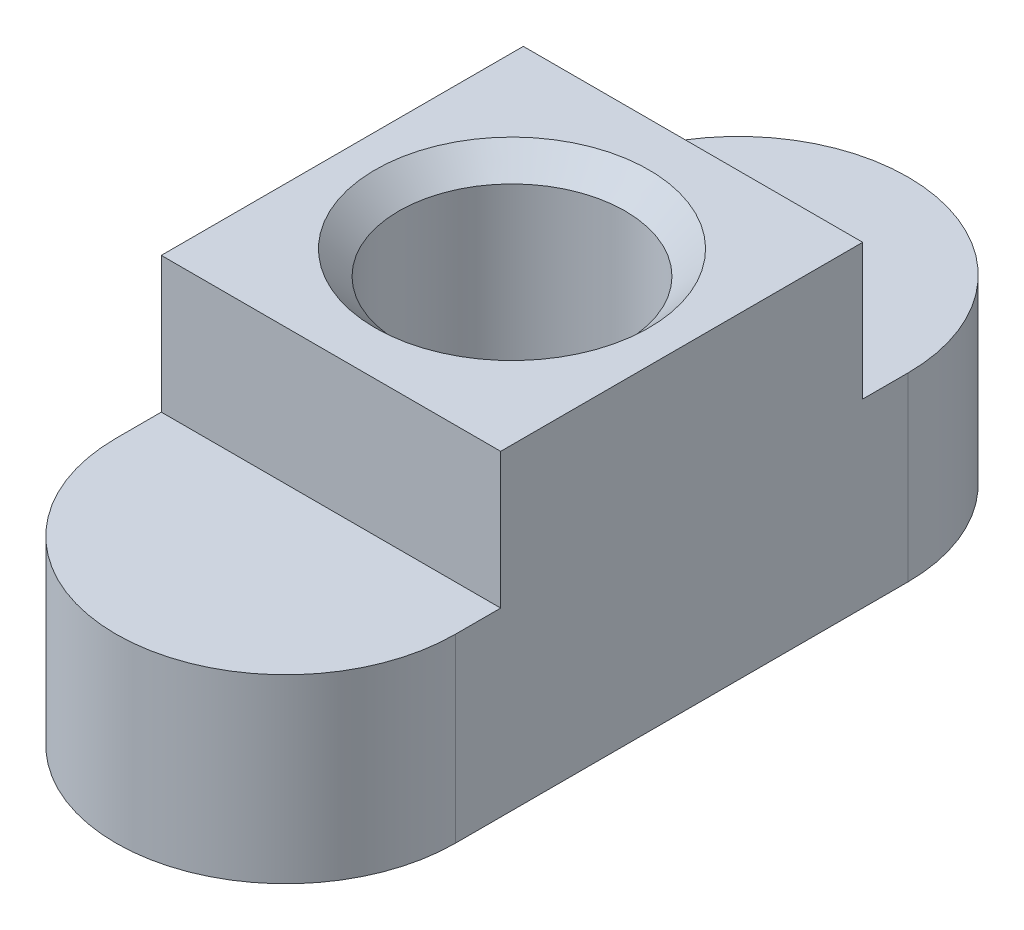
ISO-10303-21;
HEADER;
FILE_DESCRIPTION(('STEP AP214'),'2;1');
FILE_NAME('part.step','',(''),(''),'','','');
FILE_SCHEMA(('AUTOMOTIVE_DESIGN { 1 0 10303 214 1 1 1 1 }'));
ENDSEC;
DATA;
#1=APPLICATION_CONTEXT('core data for automotive mechanical design processes');
#2=APPLICATION_PROTOCOL_DEFINITION('international standard','automotive_design',2000,#1);
#3=PRODUCT_CONTEXT('',#1,'mechanical');
#4=PRODUCT('Part','Part','',(#3));
#5=PRODUCT_RELATED_PRODUCT_CATEGORY('part','',(#4));
#6=PRODUCT_DEFINITION_FORMATION('','',#4);
#7=PRODUCT_DEFINITION_CONTEXT('part definition',#1,'design');
#8=PRODUCT_DEFINITION('design','',#6,#7);
#9=PRODUCT_DEFINITION_SHAPE('','',#8);
#10=(LENGTH_UNIT() NAMED_UNIT(*) SI_UNIT(.MILLI.,.METRE.));
#11=(NAMED_UNIT(*) PLANE_ANGLE_UNIT() SI_UNIT($,.RADIAN.));
#12=(NAMED_UNIT(*) SI_UNIT($,.STERADIAN.) SOLID_ANGLE_UNIT());
#13=UNCERTAINTY_MEASURE_WITH_UNIT(LENGTH_MEASURE(1.E-05),#10,'distance_accuracy_value','');
#14=(GEOMETRIC_REPRESENTATION_CONTEXT(3) GLOBAL_UNCERTAINTY_ASSIGNED_CONTEXT((#13)) GLOBAL_UNIT_ASSIGNED_CONTEXT((#10,
#11,#12)) REPRESENTATION_CONTEXT('',''));
#15=CARTESIAN_POINT('',(0.,0.,0.));
#16=DIRECTION('',(0.,0.,1.));
#17=DIRECTION('',(1.,0.,0.));
#18=AXIS2_PLACEMENT_3D('',#15,#16,#17);
#19=CARTESIAN_POINT('',(0.,4.,5.));
#20=DIRECTION('',(0.,1.,0.));
#21=DIRECTION('',(0.,0.,1.));
#22=AXIS2_PLACEMENT_3D('',#19,#20,#21);
#23=PLANE('',#22);
#24=DIRECTION('',(1.,0.,0.));
#25=VECTOR('',#24,1.);
#26=CARTESIAN_POINT('',(-3.75,4.,4.));
#27=LINE('',#26,#25);
#28=CARTESIAN_POINT('',(-3.75,4.,4.));
#29=VERTEX_POINT('',#28);
#30=CARTESIAN_POINT('',(3.75,4.,4.));
#31=VERTEX_POINT('',#30);
#32=EDGE_CURVE('E52',#29,#31,#27,.T.);
#33=ORIENTED_EDGE('',*,*,#32,.F.);
#34=DIRECTION('',(0.,0.,1.));
#35=VECTOR('',#34,1.);
#36=CARTESIAN_POINT('',(-3.75,4.,5.));
#37=LINE('',#36,#35);
#38=CARTESIAN_POINT('',(-3.75,4.,5.));
#39=VERTEX_POINT('',#38);
#40=EDGE_CURVE('E142',#29,#39,#37,.T.);
#41=ORIENTED_EDGE('',*,*,#40,.T.);
#42=CARTESIAN_POINT('',(0.,4.,5.));
#43=DIRECTION('',(0.,1.,0.));
#44=DIRECTION('',(0.,0.,1.));
#45=AXIS2_PLACEMENT_3D('',#42,#43,#44);
#46=CIRCLE('',#45,3.75);
#47=CARTESIAN_POINT('',(3.75,4.,5.));
#48=VERTEX_POINT('',#47);
#49=EDGE_CURVE('E134',#39,#48,#46,.T.);
#50=ORIENTED_EDGE('',*,*,#49,.T.);
#51=DIRECTION('',(0.,0.,-1.));
#52=VECTOR('',#51,1.);
#53=CARTESIAN_POINT('',(3.75,4.,5.));
#54=LINE('',#53,#52);
#55=EDGE_CURVE('E138',#48,#31,#54,.T.);
#56=ORIENTED_EDGE('',*,*,#55,.T.);
#57=EDGE_LOOP('',(#33,#41,#50,#56));
#58=FACE_BOUND('',#57,.T.);
#59=ADVANCED_FACE('F37',(#58),#23,.T.);
#60=CARTESIAN_POINT('',(0.,4.,5.));
#61=DIRECTION('',(0.,-1.,0.));
#62=DIRECTION('',(0.,0.,-1.));
#63=AXIS2_PLACEMENT_3D('',#60,#61,#62);
#64=CYLINDRICAL_SURFACE('',#63,3.75);
#65=CARTESIAN_POINT('',(0.,0.,5.));
#66=DIRECTION('',(0.,1.,0.));
#67=DIRECTION('',(0.,0.,1.));
#68=AXIS2_PLACEMENT_3D('',#65,#66,#67);
#69=CIRCLE('',#68,3.75);
#70=CARTESIAN_POINT('',(-3.75,0.,5.));
#71=VERTEX_POINT('',#70);
#72=CARTESIAN_POINT('',(3.75,0.,5.));
#73=VERTEX_POINT('',#72);
#74=EDGE_CURVE('E125',#71,#73,#69,.T.);
#75=ORIENTED_EDGE('',*,*,#74,.T.);
#76=DIRECTION('',(0.,-1.,0.));
#77=VECTOR('',#76,1.);
#78=CARTESIAN_POINT('',(3.75,4.,5.));
#79=LINE('',#78,#77);
#80=EDGE_CURVE('E11',#48,#73,#79,.T.);
#81=ORIENTED_EDGE('',*,*,#80,.F.);
#82=ORIENTED_EDGE('',*,*,#49,.F.);
#83=DIRECTION('',(0.,-1.,0.));
#84=VECTOR('',#83,1.);
#85=CARTESIAN_POINT('',(-3.75,4.,5.));
#86=LINE('',#85,#84);
#87=EDGE_CURVE('E144',#39,#71,#86,.T.);
#88=ORIENTED_EDGE('',*,*,#87,.T.);
#89=EDGE_LOOP('',(#75,#81,#82,#88));
#90=FACE_BOUND('',#89,.T.);
#91=ADVANCED_FACE('F39',(#90),#64,.T.);
#92=CARTESIAN_POINT('',(3.75,4.,5.));
#93=DIRECTION('',(-1.,0.,0.));
#94=DIRECTION('',(0.,0.,1.));
#95=AXIS2_PLACEMENT_3D('',#92,#93,#94);
#96=PLANE('',#95);
#97=DIRECTION('',(0.,0.,-1.));
#98=VECTOR('',#97,1.);
#99=CARTESIAN_POINT('',(3.75,0.,5.));
#100=LINE('',#99,#98);
#101=CARTESIAN_POINT('',(3.75,0.,-5.));
#102=VERTEX_POINT('',#101);
#103=EDGE_CURVE('E128',#73,#102,#100,.T.);
#104=ORIENTED_EDGE('',*,*,#103,.T.);
#105=DIRECTION('',(0.,-1.,0.));
#106=VECTOR('',#105,1.);
#107=CARTESIAN_POINT('',(3.75,4.,-5.));
#108=LINE('',#107,#106);
#109=CARTESIAN_POINT('',(3.75,4.,-5.));
#110=VERTEX_POINT('',#109);
#111=EDGE_CURVE('E45',#110,#102,#108,.T.);
#112=ORIENTED_EDGE('',*,*,#111,.F.);
#113=CARTESIAN_POINT('',(3.75,4.,-4.));
#114=VERTEX_POINT('',#113);
#115=EDGE_CURVE('E124',#114,#110,#54,.T.);
#116=ORIENTED_EDGE('',*,*,#115,.F.);
#117=DIRECTION('',(0.,-1.,0.));
#118=VECTOR('',#117,1.);
#119=CARTESIAN_POINT('',(3.75,7.,-4.));
#120=LINE('',#119,#118);
#121=CARTESIAN_POINT('',(3.75,7.,-4.));
#122=VERTEX_POINT('',#121);
#123=EDGE_CURVE('E106',#122,#114,#120,.T.);
#124=ORIENTED_EDGE('',*,*,#123,.F.);
#125=DIRECTION('',(0.,0.,-1.));
#126=VECTOR('',#125,1.);
#127=CARTESIAN_POINT('',(3.75,7.,4.));
#128=LINE('',#127,#126);
#129=CARTESIAN_POINT('',(3.75,7.,4.));
#130=VERTEX_POINT('',#129);
#131=EDGE_CURVE('E112',#130,#122,#128,.T.);
#132=ORIENTED_EDGE('',*,*,#131,.F.);
#133=DIRECTION('',(0.,-1.,0.));
#134=VECTOR('',#133,1.);
#135=CARTESIAN_POINT('',(3.75,7.,4.));
#136=LINE('',#135,#134);
#137=EDGE_CURVE('E175',#130,#31,#136,.T.);
#138=ORIENTED_EDGE('',*,*,#137,.T.);
#139=ORIENTED_EDGE('',*,*,#55,.F.);
#140=ORIENTED_EDGE('',*,*,#80,.T.);
#141=EDGE_LOOP('',(#104,#112,#116,#124,#132,#138,#139,#140));
#142=FACE_BOUND('',#141,.T.);
#143=ADVANCED_FACE('F122',(#142),#96,.F.);
#144=CARTESIAN_POINT('',(0.,4.,-5.));
#145=DIRECTION('',(0.,-1.,0.));
#146=DIRECTION('',(0.,0.,-1.));
#147=AXIS2_PLACEMENT_3D('',#144,#145,#146);
#148=CYLINDRICAL_SURFACE('',#147,3.75);
#149=CARTESIAN_POINT('',(0.,0.,-5.));
#150=DIRECTION('',(0.,1.,0.));
#151=DIRECTION('',(0.,0.,1.));
#152=AXIS2_PLACEMENT_3D('',#149,#150,#151);
#153=CIRCLE('',#152,3.75);
#154=CARTESIAN_POINT('',(-3.75,0.,-5.));
#155=VERTEX_POINT('',#154);
#156=EDGE_CURVE('E147',#102,#155,#153,.T.);
#157=ORIENTED_EDGE('',*,*,#156,.T.);
#158=DIRECTION('',(0.,-1.,0.));
#159=VECTOR('',#158,1.);
#160=CARTESIAN_POINT('',(-3.75,4.,-5.));
#161=LINE('',#160,#159);
#162=CARTESIAN_POINT('',(-3.75,4.,-5.));
#163=VERTEX_POINT('',#162);
#164=EDGE_CURVE('E152',#163,#155,#161,.T.);
#165=ORIENTED_EDGE('',*,*,#164,.F.);
#166=CARTESIAN_POINT('',(0.,4.,-5.));
#167=DIRECTION('',(0.,1.,0.));
#168=DIRECTION('',(0.,0.,1.));
#169=AXIS2_PLACEMENT_3D('',#166,#167,#168);
#170=CIRCLE('',#169,3.75);
#171=EDGE_CURVE('E140',#110,#163,#170,.T.);
#172=ORIENTED_EDGE('',*,*,#171,.F.);
#173=ORIENTED_EDGE('',*,*,#111,.T.);
#174=EDGE_LOOP('',(#157,#165,#172,#173));
#175=FACE_BOUND('',#174,.T.);
#176=ADVANCED_FACE('F158',(#175),#148,.T.);
#177=CARTESIAN_POINT('',(-3.75,4.,5.));
#178=DIRECTION('',(1.,0.,0.));
#179=DIRECTION('',(0.,0.,-1.));
#180=AXIS2_PLACEMENT_3D('',#177,#178,#179);
#181=PLANE('',#180);
#182=DIRECTION('',(0.,0.,1.));
#183=VECTOR('',#182,1.);
#184=CARTESIAN_POINT('',(-3.75,0.,5.));
#185=LINE('',#184,#183);
#186=EDGE_CURVE('E137',#155,#71,#185,.T.);
#187=ORIENTED_EDGE('',*,*,#186,.T.);
#188=ORIENTED_EDGE('',*,*,#87,.F.);
#189=ORIENTED_EDGE('',*,*,#40,.F.);
#190=DIRECTION('',(0.,-1.,0.));
#191=VECTOR('',#190,1.);
#192=CARTESIAN_POINT('',(-3.75,7.,4.));
#193=LINE('',#192,#191);
#194=CARTESIAN_POINT('',(-3.75,7.,4.));
#195=VERTEX_POINT('',#194);
#196=EDGE_CURVE('E130',#195,#29,#193,.T.);
#197=ORIENTED_EDGE('',*,*,#196,.F.);
#198=DIRECTION('',(0.,0.,1.));
#199=VECTOR('',#198,1.);
#200=CARTESIAN_POINT('',(-3.75,7.,4.));
#201=LINE('',#200,#199);
#202=CARTESIAN_POINT('',(-3.75,7.,-4.));
#203=VERTEX_POINT('',#202);
#204=EDGE_CURVE('E111',#203,#195,#201,.T.);
#205=ORIENTED_EDGE('',*,*,#204,.F.);
#206=DIRECTION('',(0.,-1.,0.));
#207=VECTOR('',#206,1.);
#208=CARTESIAN_POINT('',(-3.75,7.,-4.));
#209=LINE('',#208,#207);
#210=CARTESIAN_POINT('',(-3.75,4.,-4.));
#211=VERTEX_POINT('',#210);
#212=EDGE_CURVE('E108',#203,#211,#209,.T.);
#213=ORIENTED_EDGE('',*,*,#212,.T.);
#214=EDGE_CURVE('E143',#163,#211,#37,.T.);
#215=ORIENTED_EDGE('',*,*,#214,.F.);
#216=ORIENTED_EDGE('',*,*,#164,.T.);
#217=EDGE_LOOP('',(#187,#188,#189,#197,#205,#213,#215,#216));
#218=FACE_BOUND('',#217,.T.);
#219=ADVANCED_FACE('F166',(#218),#181,.F.);
#220=DIRECTION('',(-1.,0.,0.));
#221=VECTOR('',#220,1.);
#222=CARTESIAN_POINT('',(-3.75,4.,-4.));
#223=LINE('',#222,#221);
#224=EDGE_CURVE('E60',#114,#211,#223,.T.);
#225=ORIENTED_EDGE('',*,*,#224,.F.);
#226=ORIENTED_EDGE('',*,*,#115,.T.);
#227=ORIENTED_EDGE('',*,*,#171,.T.);
#228=ORIENTED_EDGE('',*,*,#214,.T.);
#229=EDGE_LOOP('',(#225,#226,#227,#228));
#230=FACE_BOUND('',#229,.T.);
#231=ADVANCED_FACE('F206',(#230),#23,.T.);
#232=CARTESIAN_POINT('',(0.,0.,5.));
#233=DIRECTION('',(0.,1.,0.));
#234=DIRECTION('',(0.,0.,1.));
#235=AXIS2_PLACEMENT_3D('',#232,#233,#234);
#236=PLANE('',#235);
#237=CARTESIAN_POINT('',(0.,0.,0.));
#238=DIRECTION('',(0.,1.,0.));
#239=DIRECTION('',(0.,0.,1.));
#240=AXIS2_PLACEMENT_3D('',#237,#238,#239);
#241=CIRCLE('',#240,2.5);
#242=CARTESIAN_POINT('',(0.,0.,2.5));
#243=VERTEX_POINT('',#242);
#244=EDGE_CURVE('E180',#243,#243,#241,.T.);
#245=ORIENTED_EDGE('',*,*,#244,.T.);
#246=EDGE_LOOP('',(#245));
#247=FACE_BOUND('',#246,.T.);
#248=ORIENTED_EDGE('',*,*,#74,.F.);
#249=ORIENTED_EDGE('',*,*,#186,.F.);
#250=ORIENTED_EDGE('',*,*,#156,.F.);
#251=ORIENTED_EDGE('',*,*,#103,.F.);
#252=EDGE_LOOP('',(#248,#249,#250,#251));
#253=FACE_BOUND('',#252,.T.);
#254=ADVANCED_FACE('F163',(#247,#253),#236,.F.);
#255=CARTESIAN_POINT('',(-3.75,7.,-4.));
#256=DIRECTION('',(0.,0.,1.));
#257=DIRECTION('',(1.,0.,0.));
#258=AXIS2_PLACEMENT_3D('',#255,#256,#257);
#259=PLANE('',#258);
#260=ORIENTED_EDGE('',*,*,#224,.T.);
#261=ORIENTED_EDGE('',*,*,#212,.F.);
#262=DIRECTION('',(-1.,0.,0.));
#263=VECTOR('',#262,1.);
#264=CARTESIAN_POINT('',(-3.75,7.,-4.));
#265=LINE('',#264,#263);
#266=EDGE_CURVE('E102',#122,#203,#265,.T.);
#267=ORIENTED_EDGE('',*,*,#266,.F.);
#268=ORIENTED_EDGE('',*,*,#123,.T.);
#269=EDGE_LOOP('',(#260,#261,#267,#268));
#270=FACE_BOUND('',#269,.T.);
#271=ADVANCED_FACE('F104',(#270),#259,.F.);
#272=CARTESIAN_POINT('',(-3.75,7.,4.));
#273=DIRECTION('',(0.,0.,-1.));
#274=DIRECTION('',(-1.,0.,0.));
#275=AXIS2_PLACEMENT_3D('',#272,#273,#274);
#276=PLANE('',#275);
#277=ORIENTED_EDGE('',*,*,#32,.T.);
#278=ORIENTED_EDGE('',*,*,#137,.F.);
#279=DIRECTION('',(1.,0.,0.));
#280=VECTOR('',#279,1.);
#281=CARTESIAN_POINT('',(-3.75,7.,4.));
#282=LINE('',#281,#280);
#283=EDGE_CURVE('E117',#195,#130,#282,.T.);
#284=ORIENTED_EDGE('',*,*,#283,.F.);
#285=ORIENTED_EDGE('',*,*,#196,.T.);
#286=EDGE_LOOP('',(#277,#278,#284,#285));
#287=FACE_BOUND('',#286,.T.);
#288=ADVANCED_FACE('F174',(#287),#276,.F.);
#289=CARTESIAN_POINT('',(0.,7.,0.));
#290=DIRECTION('',(0.,-1.,0.));
#291=DIRECTION('',(0.,0.,-1.));
#292=AXIS2_PLACEMENT_3D('',#289,#290,#291);
#293=PLANE('',#292);
#294=CARTESIAN_POINT('',(0.,7.,0.));
#295=DIRECTION('',(0.,1.,0.));
#296=DIRECTION('',(0.,0.,1.));
#297=AXIS2_PLACEMENT_3D('',#294,#295,#296);
#298=CIRCLE('',#297,3.025);
#299=CARTESIAN_POINT('',(0.,7.,3.025));
#300=VERTEX_POINT('',#299);
#301=EDGE_CURVE('E188',#300,#300,#298,.T.);
#302=ORIENTED_EDGE('',*,*,#301,.F.);
#303=EDGE_LOOP('',(#302));
#304=FACE_BOUND('',#303,.T.);
#305=ORIENTED_EDGE('',*,*,#131,.T.);
#306=ORIENTED_EDGE('',*,*,#266,.T.);
#307=ORIENTED_EDGE('',*,*,#204,.T.);
#308=ORIENTED_EDGE('',*,*,#283,.T.);
#309=EDGE_LOOP('',(#305,#306,#307,#308));
#310=FACE_BOUND('',#309,.T.);
#311=ADVANCED_FACE('F115',(#304,#310),#293,.F.);
#312=CARTESIAN_POINT('',(0.,7.,0.));
#313=DIRECTION('',(0.,1.,0.));
#314=DIRECTION('',(0.,0.,1.));
#315=AXIS2_PLACEMENT_3D('',#312,#313,#314);
#316=CYLINDRICAL_SURFACE('',#315,2.5);
#317=ORIENTED_EDGE('',*,*,#244,.F.);
#318=EDGE_LOOP('',(#317));
#319=FACE_BOUND('',#318,.T.);
#320=CARTESIAN_POINT('',(0.,6.475,0.));
#321=DIRECTION('',(0.,1.,0.));
#322=DIRECTION('',(0.,0.,1.));
#323=AXIS2_PLACEMENT_3D('',#320,#321,#322);
#324=CIRCLE('',#323,2.5);
#325=CARTESIAN_POINT('',(0.,6.475,2.5));
#326=VERTEX_POINT('',#325);
#327=EDGE_CURVE('E185',#326,#326,#324,.T.);
#328=ORIENTED_EDGE('',*,*,#327,.T.);
#329=EDGE_LOOP('',(#328));
#330=FACE_BOUND('',#329,.T.);
#331=ADVANCED_FACE('F195',(#319,#330),#316,.F.);
#332=CARTESIAN_POINT('',(0.,7.,0.));
#333=DIRECTION('',(0.,1.,0.));
#334=DIRECTION('',(0.,0.,1.));
#335=AXIS2_PLACEMENT_3D('',#332,#333,#334);
#336=CONICAL_SURFACE('',#335,3.025,0.78539816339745);
#337=ORIENTED_EDGE('',*,*,#327,.F.);
#338=EDGE_LOOP('',(#337));
#339=FACE_BOUND('',#338,.T.);
#340=ORIENTED_EDGE('',*,*,#301,.T.);
#341=EDGE_LOOP('',(#340));
#342=FACE_BOUND('',#341,.T.);
#343=ADVANCED_FACE('F192',(#339,#342),#336,.F.);
#344=CLOSED_SHELL('',(#59,#91,#143,#176,#219,#231,#254,#271,#288,#311,#331,#343));
#345=MANIFOLD_SOLID_BREP('B2',#344);
#346=ADVANCED_BREP_SHAPE_REPRESENTATION('',(#18,#345),#14);
#347=SHAPE_DEFINITION_REPRESENTATION(#9,#346);
ENDSEC;
END-ISO-10303-21;
